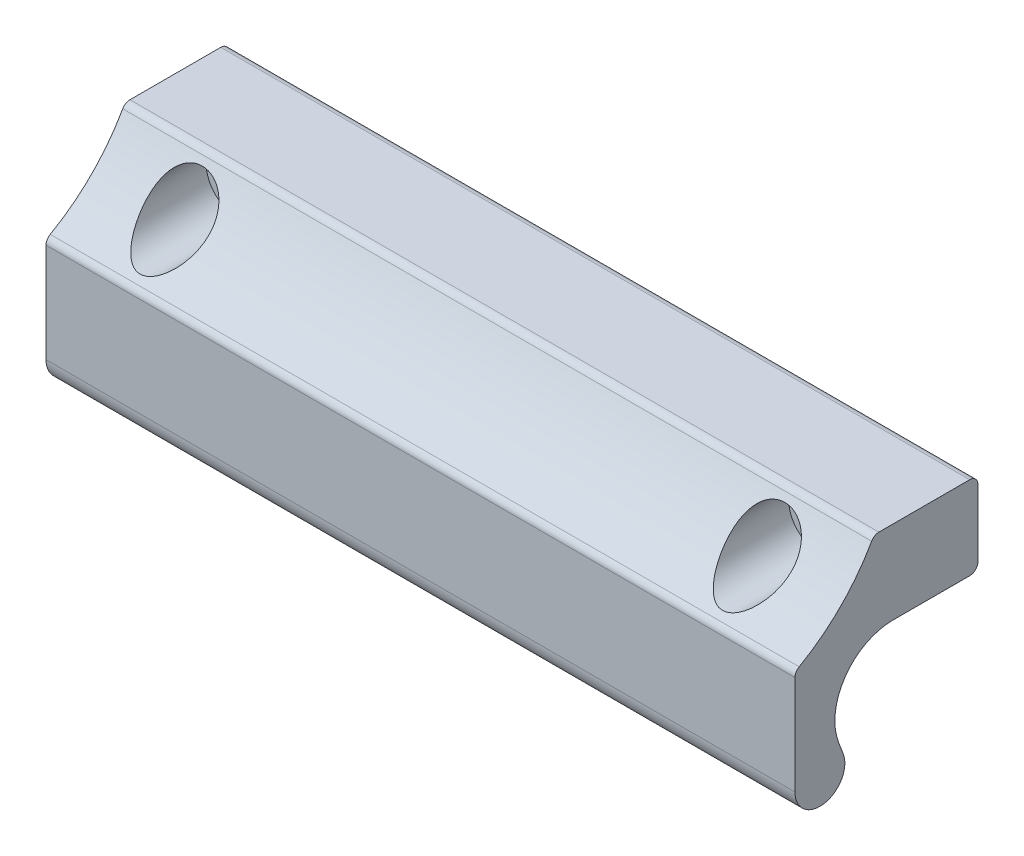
ISO-10303-21;
HEADER;
FILE_DESCRIPTION(('STEP AP214'),'2;1');
FILE_NAME('part.step','',(''),(''),'','','');
FILE_SCHEMA(('AUTOMOTIVE_DESIGN { 1 0 10303 214 1 1 1 1 }'));
ENDSEC;
DATA;
#1=APPLICATION_CONTEXT('core data for automotive mechanical design processes');
#2=APPLICATION_PROTOCOL_DEFINITION('international standard','automotive_design',2000,#1);
#3=PRODUCT_CONTEXT('',#1,'mechanical');
#4=PRODUCT('Part','Part','',(#3));
#5=PRODUCT_RELATED_PRODUCT_CATEGORY('part','',(#4));
#6=PRODUCT_DEFINITION_FORMATION('','',#4);
#7=PRODUCT_DEFINITION_CONTEXT('part definition',#1,'design');
#8=PRODUCT_DEFINITION('design','',#6,#7);
#9=PRODUCT_DEFINITION_SHAPE('','',#8);
#10=(LENGTH_UNIT() NAMED_UNIT(*) SI_UNIT(.MILLI.,.METRE.));
#11=(NAMED_UNIT(*) PLANE_ANGLE_UNIT() SI_UNIT($,.RADIAN.));
#12=(NAMED_UNIT(*) SI_UNIT($,.STERADIAN.) SOLID_ANGLE_UNIT());
#13=UNCERTAINTY_MEASURE_WITH_UNIT(LENGTH_MEASURE(1.E-05),#10,'distance_accuracy_value','');
#14=(GEOMETRIC_REPRESENTATION_CONTEXT(3) GLOBAL_UNCERTAINTY_ASSIGNED_CONTEXT((#13)) GLOBAL_UNIT_ASSIGNED_CONTEXT((#10,
#11,#12)) REPRESENTATION_CONTEXT('',''));
#15=CARTESIAN_POINT('',(0.,0.,0.));
#16=DIRECTION('',(0.,0.,1.));
#17=DIRECTION('',(1.,0.,0.));
#18=AXIS2_PLACEMENT_3D('',#15,#16,#17);
#19=CARTESIAN_POINT('',(-10.,15.8043402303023,32.8043402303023));
#20=DIRECTION('',(1.,0.,0.));
#21=DIRECTION('',(0.,1.,0.));
#22=AXIS2_PLACEMENT_3D('',#19,#20,#21);
#23=CYLINDRICAL_SURFACE('',#22,23.);
#24=CARTESIAN_POINT('',(73.75,0.,16.094378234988));
#25=CARTESIAN_POINT('',(73.7500006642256,-0.150169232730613,16.236409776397));
#26=CARTESIAN_POINT('',(73.7409857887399,-0.298458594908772,16.3805076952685));
#27=CARTESIAN_POINT('',(73.7061827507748,-0.590181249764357,16.6716960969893));
#28=CARTESIAN_POINT('',(73.6803814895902,-0.733610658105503,16.8187888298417));
#29=CARTESIAN_POINT('',(73.6128217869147,-1.01544237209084,17.1155863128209));
#30=CARTESIAN_POINT('',(73.5709823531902,-1.15381519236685,17.2653005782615));
#31=CARTESIAN_POINT('',(73.4720695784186,-1.42405592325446,17.5654707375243));
#32=CARTESIAN_POINT('',(73.4150003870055,-1.55592559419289,17.7159264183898));
#33=CARTESIAN_POINT('',(73.2849647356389,-1.81460439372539,18.0187712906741));
#34=CARTESIAN_POINT('',(73.2117670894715,-1.9413043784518,18.1711545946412));
#35=CARTESIAN_POINT('',(73.0498715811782,-2.1868769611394,18.4741574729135));
#36=CARTESIAN_POINT('',(72.9611662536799,-2.30574575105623,18.6247761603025));
#37=CARTESIAN_POINT('',(72.7681376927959,-2.53420019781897,18.9215160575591));
#38=CARTESIAN_POINT('',(72.6638971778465,-2.64383047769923,19.067656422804));
#39=CARTESIAN_POINT('',(72.4382918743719,-2.853229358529,19.3534526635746));
#40=CARTESIAN_POINT('',(72.316948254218,-2.95300989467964,19.493116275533));
#41=CARTESIAN_POINT('',(72.0789502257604,-3.12374564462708,19.7373761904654));
#42=CARTESIAN_POINT('',(71.965498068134,-3.19663498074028,19.8437139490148));
#43=CARTESIAN_POINT('',(71.7241156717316,-3.33304729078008,20.045999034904));
#44=CARTESIAN_POINT('',(71.5961684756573,-3.39655909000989,20.1419339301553));
#45=CARTESIAN_POINT('',(71.3222714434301,-3.51232726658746,20.3192407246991));
#46=CARTESIAN_POINT('',(71.1760841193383,-3.56440400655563,20.4003772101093));
#47=CARTESIAN_POINT('',(70.9451529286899,-3.62981593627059,20.5033135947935));
#48=CARTESIAN_POINT('',(70.8663403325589,-3.64948596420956,20.5344702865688));
#49=CARTESIAN_POINT('',(70.7051956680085,-3.68401760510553,20.5893923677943));
#50=CARTESIAN_POINT('',(70.6228662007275,-3.69888270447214,20.6131631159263));
#51=CARTESIAN_POINT('',(70.4293848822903,-3.72697994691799,20.658210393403));
#52=CARTESIAN_POINT('',(70.3172035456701,-3.73828046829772,20.6764343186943));
#53=CARTESIAN_POINT('',(70.0908651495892,-3.75060996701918,20.6963234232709));
#54=CARTESIAN_POINT('',(69.9767093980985,-3.75164550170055,20.6979991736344));
#55=CARTESIAN_POINT('',(69.7498794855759,-3.74336926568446,20.6846411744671));
#56=CARTESIAN_POINT('',(69.6372042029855,-3.73406584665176,20.669620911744));
#57=CARTESIAN_POINT('',(69.4161596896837,-3.70595298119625,20.6244737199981));
#58=CARTESIAN_POINT('',(69.3077946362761,-3.68713454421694,20.5943325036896));
#59=CARTESIAN_POINT('',(69.0562251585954,-3.6323825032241,20.5072938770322));
#60=CARTESIAN_POINT('',(68.9158969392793,-3.59263719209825,20.4445472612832));
#61=CARTESIAN_POINT('',(68.6486494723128,-3.50092089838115,20.3017774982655));
#62=CARTESIAN_POINT('',(68.5217650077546,-3.44891927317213,20.2217110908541));
#63=CARTESIAN_POINT('',(68.303724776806,-3.34616134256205,20.0659999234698));
#64=CARTESIAN_POINT('',(68.2103375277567,-3.29701024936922,19.9923557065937));
#65=CARTESIAN_POINT('',(68.0314834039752,-3.19345122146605,19.839292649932));
#66=CARTESIAN_POINT('',(67.946021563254,-3.13903998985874,19.7598701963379));
#67=CARTESIAN_POINT('',(67.7823320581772,-3.02562036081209,19.5966727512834));
#68=CARTESIAN_POINT('',(67.704116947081,-2.96660430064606,19.5128905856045));
#69=CARTESIAN_POINT('',(67.554530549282,-2.84455534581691,19.3421814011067));
#70=CARTESIAN_POINT('',(67.4831614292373,-2.7815211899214,19.255253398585));
#71=CARTESIAN_POINT('',(67.3069800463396,-2.61388606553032,19.0275868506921));
#72=CARTESIAN_POINT('',(67.2070155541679,-2.50653247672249,18.8851063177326));
#73=CARTESIAN_POINT('',(67.022064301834,-2.28371602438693,18.5967547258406));
#74=CARTESIAN_POINT('',(66.9370856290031,-2.16824882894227,18.4508818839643));
#75=CARTESIAN_POINT('',(66.7815301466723,-1.92982538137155,18.1573214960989));
#76=CARTESIAN_POINT('',(66.710967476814,-1.80686192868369,18.0096323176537));
#77=CARTESIAN_POINT('',(66.5842889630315,-1.55415187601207,17.7139267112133));
#78=CARTESIAN_POINT('',(66.5281703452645,-1.42440658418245,17.565910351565));
#79=CARTESIAN_POINT('',(66.4294697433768,-1.15535678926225,17.2669625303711));
#80=CARTESIAN_POINT('',(66.3872582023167,-1.01589497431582,17.116049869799));
#81=CARTESIAN_POINT('',(66.3190319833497,-0.731044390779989,16.8160994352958));
#82=CARTESIAN_POINT('',(66.293019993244,-0.585654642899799,16.667061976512));
#83=CARTESIAN_POINT('',(66.25828003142,-0.29005579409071,16.3722410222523));
#84=CARTESIAN_POINT('',(66.2495221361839,-0.139855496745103,16.2264523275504));
#85=CARTESIAN_POINT('',(66.2505179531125,0.164377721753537,15.9391279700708));
#86=CARTESIAN_POINT('',(66.2602636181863,0.318408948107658,15.7975904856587));
#87=CARTESIAN_POINT('',(66.3079126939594,0.692581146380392,15.4630412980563));
#88=CARTESIAN_POINT('',(66.3557102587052,0.913971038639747,15.2726783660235));
#89=CARTESIAN_POINT('',(66.495799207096,1.35518812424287,14.9073062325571));
#90=CARTESIAN_POINT('',(66.588026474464,1.57501710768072,14.7322753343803));
#91=CARTESIAN_POINT('',(66.7991197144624,1.9636736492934,14.4335970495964));
#92=CARTESIAN_POINT('',(66.909662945,2.13429131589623,14.3064889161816));
#93=CARTESIAN_POINT('',(67.1001727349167,2.3799745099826,14.1282393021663));
#94=CARTESIAN_POINT('',(67.1678322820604,2.46019965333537,14.0708656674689));
#95=CARTESIAN_POINT('',(67.3113580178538,2.61628143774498,13.9606622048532));
#96=CARTESIAN_POINT('',(67.3872204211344,2.69214006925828,13.907830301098));
#97=CARTESIAN_POINT('',(67.5477452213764,2.83917333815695,13.806643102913));
#98=CARTESIAN_POINT('',(67.6324832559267,2.91029755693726,13.758334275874));
#99=CARTESIAN_POINT('',(67.8097619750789,3.04594886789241,13.6672003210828));
#100=CARTESIAN_POINT('',(67.902298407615,3.11047951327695,13.6243722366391));
#101=CARTESIAN_POINT('',(68.0946077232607,3.23185755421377,13.5445905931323));
#102=CARTESIAN_POINT('',(68.1943773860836,3.28870833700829,13.5076344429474));
#103=CARTESIAN_POINT('',(68.4004020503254,3.39369189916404,13.4399472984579));
#104=CARTESIAN_POINT('',(68.5066557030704,3.44182648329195,13.4092150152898));
#105=CARTESIAN_POINT('',(68.7083226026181,3.52193401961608,13.3584049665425));
#106=CARTESIAN_POINT('',(68.8029778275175,3.55524764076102,13.3374209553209));
#107=CARTESIAN_POINT('',(68.9955300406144,3.61437106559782,13.3003439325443));
#108=CARTESIAN_POINT('',(69.0934265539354,3.64018196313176,13.2842502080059));
#109=CARTESIAN_POINT('',(69.2915997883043,3.68387839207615,13.2570880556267));
#110=CARTESIAN_POINT('',(69.3918751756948,3.70176825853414,13.2460168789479));
#111=CARTESIAN_POINT('',(69.5939747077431,3.72934871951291,13.2289770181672));
#112=CARTESIAN_POINT('',(69.6957987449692,3.73903988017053,13.2230079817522));
#113=CARTESIAN_POINT('',(69.8896006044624,3.74949905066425,13.2165676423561));
#114=CARTESIAN_POINT('',(69.9815192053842,3.751079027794,13.2155960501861));
#115=CARTESIAN_POINT('',(70.1652063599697,3.7474856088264,13.2178075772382));
#116=CARTESIAN_POINT('',(70.2569748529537,3.74230994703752,13.2209920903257));
#117=CARTESIAN_POINT('',(70.4395972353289,3.72527248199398,13.2314961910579));
#118=CARTESIAN_POINT('',(70.5304516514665,3.71341478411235,13.2388132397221));
#119=CARTESIAN_POINT('',(70.7106535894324,3.68318293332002,13.2575283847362));
#120=CARTESIAN_POINT('',(70.8000005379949,3.66480635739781,13.2689279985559));
#121=CARTESIAN_POINT('',(71.0615737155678,3.60101108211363,13.3086664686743));
#122=CARTESIAN_POINT('',(71.2308516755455,3.54658365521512,13.3427515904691));
#123=CARTESIAN_POINT('',(71.5568664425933,3.41607587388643,13.4255677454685));
#124=CARTESIAN_POINT('',(71.7136012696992,3.33999210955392,13.4743010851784));
#125=CARTESIAN_POINT('',(72.0192314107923,3.1650856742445,13.5881842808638));
#126=CARTESIAN_POINT('',(72.1672994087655,3.06528886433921,13.6540540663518));
#127=CARTESIAN_POINT('',(72.443829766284,2.84973334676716,13.7992083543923));
#128=CARTESIAN_POINT('',(72.5722875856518,2.73397095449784,13.8784959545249));
#129=CARTESIAN_POINT('',(72.8221710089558,2.47661423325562,14.0586987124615));
#130=CARTESIAN_POINT('',(72.9410681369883,2.33358067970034,14.1610543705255));
#131=CARTESIAN_POINT('',(73.1530779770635,2.03807613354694,14.378170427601));
#132=CARTESIAN_POINT('',(73.2461621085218,1.8855949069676,14.4929443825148));
#133=CARTESIAN_POINT('',(73.4441188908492,1.50504726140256,14.7873723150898));
#134=CARTESIAN_POINT('',(73.5350714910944,1.27416834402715,14.9727785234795));
#135=CARTESIAN_POINT('',(73.668890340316,0.812200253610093,15.3593785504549));
#136=CARTESIAN_POINT('',(73.7117581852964,0.581111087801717,15.5605718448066));
#137=CARTESIAN_POINT('',(73.7389347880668,0.293978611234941,15.8209607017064));
#138=CARTESIAN_POINT('',(73.7431071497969,0.234797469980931,15.8751995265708));
#139=CARTESIAN_POINT('',(73.7486383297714,0.116983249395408,15.9843147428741));
#140=CARTESIAN_POINT('',(73.7499997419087,0.0583497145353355,16.0391904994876));
#141=CARTESIAN_POINT('',(73.75,0.,16.094378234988));
#142=B_SPLINE_CURVE_WITH_KNOTS('',3,(#24,#25,#26,#27,#28,#29,#30,#31,#32,#33,#34,#35,#36,#37,
#38,#39,#40,#41,#42,#43,#44,#45,#46,#47,#48,#49,#50,#51,#52,#53,#54,#55,#56,#57,#58,#59,#60,#61,
#62,#63,#64,#65,#66,#67,#68,#69,#70,#71,#72,#73,#74,#75,#76,#77,#78,#79,#80,#81,#82,#83,#84,#85,
#86,#87,#88,#89,#90,#91,#92,#93,#94,#95,#96,#97,#98,#99,#100,#101,#102,#103,#104,#105,#106,#107,
#108,#109,#110,#111,#112,#113,#114,#115,#116,#117,#118,#119,#120,#121,#122,#123,#124,#125,#126,
#127,#128,#129,#130,#131,#132,#133,#134,#135,#136,#137,#138,#139,#140,#141),.UNSPECIFIED.,.T.,
.F.,(4,2,2,2,2,2,2,2,2,2,2,2,2,2,2,2,2,2,2,2,2,2,2,2,2,2,2,2,2,2,2,2,2,2,2,2,2,2,2,2,2,2,2,2,2,
2,2,2,2,2,2,2,2,2,2,2,2,2,4),(0.,0.620002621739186,1.24048962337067,1.8641522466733,
2.48764511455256,3.12073548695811,3.75413147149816,4.38426801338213,5.01363137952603,
5.52787354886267,6.04272365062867,6.56516003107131,6.82572511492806,7.08610070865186,
7.42711756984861,7.76791657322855,8.10844048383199,8.44928675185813,8.92293422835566,
9.39777869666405,9.78331644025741,10.1690974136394,10.5555346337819,10.9420937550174,
11.5546950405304,12.1676259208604,12.7811551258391,13.3945664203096,14.0231985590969,
14.6519349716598,15.2795800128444,15.9069521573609,16.7911651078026,17.6741058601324,
18.3902630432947,18.7487042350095,19.1069807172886,19.4686065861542,19.8300365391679,
20.1913065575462,20.5525016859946,20.8596314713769,21.166716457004,21.4736331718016,
21.7805286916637,22.056004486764,22.3315726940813,22.606971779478,22.8824733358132,
23.422984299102,23.9635804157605,24.532194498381,25.100940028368,25.7354158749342,
26.370591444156,27.2948858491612,28.2191495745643,28.4602802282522,28.7011882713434),.UNSPECIFIED.);
#143=CARTESIAN_POINT('',(73.75,0.,16.094378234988));
#144=VERTEX_POINT('',#143);
#145=EDGE_CURVE('E18',#144,#144,#142,.T.);
#146=ORIENTED_EDGE('',*,*,#145,.T.);
#147=EDGE_LOOP('',(#146));
#148=FACE_BOUND('',#147,.T.);
#149=CARTESIAN_POINT('',(3.75,0.,16.094378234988));
#150=CARTESIAN_POINT('',(3.75000066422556,-0.150169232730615,16.236409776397));
#151=CARTESIAN_POINT('',(3.74098578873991,-0.298458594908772,16.3805076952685));
#152=CARTESIAN_POINT('',(3.70618275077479,-0.590181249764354,16.6716960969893));
#153=CARTESIAN_POINT('',(3.68038148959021,-0.7336106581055,16.8187888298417));
#154=CARTESIAN_POINT('',(3.61282178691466,-1.01544237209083,17.1155863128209));
#155=CARTESIAN_POINT('',(3.57098235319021,-1.15381519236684,17.2653005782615));
#156=CARTESIAN_POINT('',(3.47206957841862,-1.42405592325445,17.5654707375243));
#157=CARTESIAN_POINT('',(3.41500038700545,-1.55592559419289,17.7159264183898));
#158=CARTESIAN_POINT('',(3.28496473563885,-1.81460439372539,18.0187712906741));
#159=CARTESIAN_POINT('',(3.21176708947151,-1.9413043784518,18.1711545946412));
#160=CARTESIAN_POINT('',(3.04987158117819,-2.1868769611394,18.4741574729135));
#161=CARTESIAN_POINT('',(2.96116625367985,-2.30574575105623,18.6247761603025));
#162=CARTESIAN_POINT('',(2.76813769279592,-2.53420019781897,18.9215160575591));
#163=CARTESIAN_POINT('',(2.66389717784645,-2.64383047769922,19.067656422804));
#164=CARTESIAN_POINT('',(2.43829187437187,-2.853229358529,19.3534526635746));
#165=CARTESIAN_POINT('',(2.316948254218,-2.95300989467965,19.493116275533));
#166=CARTESIAN_POINT('',(2.07895022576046,-3.12374564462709,19.7373761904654));
#167=CARTESIAN_POINT('',(1.965498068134,-3.19663498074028,19.8437139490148));
#168=CARTESIAN_POINT('',(1.72411567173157,-3.33304729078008,20.045999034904));
#169=CARTESIAN_POINT('',(1.59616847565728,-3.3965590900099,20.1419339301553));
#170=CARTESIAN_POINT('',(1.32227144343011,-3.51232726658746,20.3192407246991));
#171=CARTESIAN_POINT('',(1.1760841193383,-3.56440400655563,20.4003772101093));
#172=CARTESIAN_POINT('',(0.9451529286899,-3.62981593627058,20.5033135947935));
#173=CARTESIAN_POINT('',(0.866340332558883,-3.64948596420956,20.5344702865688));
#174=CARTESIAN_POINT('',(0.705195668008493,-3.68401760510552,20.5893923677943));
#175=CARTESIAN_POINT('',(0.622866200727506,-3.69888270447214,20.6131631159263));
#176=CARTESIAN_POINT('',(0.429384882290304,-3.72697994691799,20.658210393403));
#177=CARTESIAN_POINT('',(0.31720354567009,-3.73828046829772,20.6764343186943));
#178=CARTESIAN_POINT('',(0.0908651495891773,-3.75060996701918,20.6963234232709));
#179=CARTESIAN_POINT('',(-0.0232906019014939,-3.75164550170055,20.6979991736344));
#180=CARTESIAN_POINT('',(-0.250120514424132,-3.74336926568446,20.6846411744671));
#181=CARTESIAN_POINT('',(-0.362795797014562,-3.73406584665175,20.669620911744));
#182=CARTESIAN_POINT('',(-0.583840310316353,-3.70595298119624,20.6244737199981));
#183=CARTESIAN_POINT('',(-0.692205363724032,-3.68713454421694,20.5943325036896));
#184=CARTESIAN_POINT('',(-0.943774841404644,-3.63238250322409,20.5072938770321));
#185=CARTESIAN_POINT('',(-1.0841030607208,-3.59263719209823,20.4445472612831));
#186=CARTESIAN_POINT('',(-1.35135052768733,-3.50092089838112,20.3017774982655));
#187=CARTESIAN_POINT('',(-1.47823499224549,-3.44891927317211,20.221711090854));
#188=CARTESIAN_POINT('',(-1.6962752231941,-3.34616134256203,20.0659999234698));
#189=CARTESIAN_POINT('',(-1.7896624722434,-3.29701024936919,19.9923557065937));
#190=CARTESIAN_POINT('',(-1.9685165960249,-3.19345122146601,19.839292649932));
#191=CARTESIAN_POINT('',(-2.0539784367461,-3.1390399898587,19.7598701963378));
#192=CARTESIAN_POINT('',(-2.21766794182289,-3.02562036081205,19.5966727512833));
#193=CARTESIAN_POINT('',(-2.29588305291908,-2.96660430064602,19.5128905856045));
#194=CARTESIAN_POINT('',(-2.44546945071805,-2.84455534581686,19.3421814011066));
#195=CARTESIAN_POINT('',(-2.51683857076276,-2.78152118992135,19.255253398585));
#196=CARTESIAN_POINT('',(-2.69301995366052,-2.61388606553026,19.0275868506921));
#197=CARTESIAN_POINT('',(-2.79298444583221,-2.50653247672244,18.8851063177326));
#198=CARTESIAN_POINT('',(-2.97793569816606,-2.28371602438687,18.5967547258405));
#199=CARTESIAN_POINT('',(-3.06291437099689,-2.16824882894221,18.4508818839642));
#200=CARTESIAN_POINT('',(-3.21846985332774,-1.92982538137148,18.1573214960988));
#201=CARTESIAN_POINT('',(-3.28903252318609,-1.80686192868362,18.0096323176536));
#202=CARTESIAN_POINT('',(-3.41571103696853,-1.554151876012,17.7139267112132));
#203=CARTESIAN_POINT('',(-3.47182965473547,-1.42440658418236,17.5659103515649));
#204=CARTESIAN_POINT('',(-3.57053025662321,-1.15535678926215,17.266962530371));
#205=CARTESIAN_POINT('',(-3.61274179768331,-1.01589497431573,17.1160498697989));
#206=CARTESIAN_POINT('',(-3.68096801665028,-0.731044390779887,16.8160994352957));
#207=CARTESIAN_POINT('',(-3.70698000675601,-0.585654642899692,16.6670619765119));
#208=CARTESIAN_POINT('',(-3.74171996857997,-0.290055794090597,16.3722410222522));
#209=CARTESIAN_POINT('',(-3.75047786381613,-0.139855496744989,16.2264523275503));
#210=CARTESIAN_POINT('',(-3.74948204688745,0.164377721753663,15.9391279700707));
#211=CARTESIAN_POINT('',(-3.73973638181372,0.318408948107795,15.7975904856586));
#212=CARTESIAN_POINT('',(-3.69208730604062,0.692581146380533,15.4630412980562));
#213=CARTESIAN_POINT('',(-3.64428974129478,0.913971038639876,15.2726783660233));
#214=CARTESIAN_POINT('',(-3.50420079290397,1.35518812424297,14.907306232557));
#215=CARTESIAN_POINT('',(-3.41197352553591,1.57501710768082,14.7322753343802));
#216=CARTESIAN_POINT('',(-3.20088028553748,1.9636736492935,14.4335970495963));
#217=CARTESIAN_POINT('',(-3.09033705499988,2.13429131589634,14.3064889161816));
#218=CARTESIAN_POINT('',(-2.89982726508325,2.37997450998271,14.1282393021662));
#219=CARTESIAN_POINT('',(-2.83216771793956,2.46019965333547,14.0708656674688));
#220=CARTESIAN_POINT('',(-2.68864198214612,2.61628143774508,13.9606622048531));
#221=CARTESIAN_POINT('',(-2.61277957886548,2.69214006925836,13.9078303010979));
#222=CARTESIAN_POINT('',(-2.45225477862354,2.83917333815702,13.806643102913));
#223=CARTESIAN_POINT('',(-2.3675167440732,2.91029755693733,13.758334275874));
#224=CARTESIAN_POINT('',(-2.19023802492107,3.04594886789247,13.6672003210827));
#225=CARTESIAN_POINT('',(-2.09770159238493,3.11047951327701,13.624372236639));
#226=CARTESIAN_POINT('',(-1.90539227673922,3.23185755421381,13.5445905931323));
#227=CARTESIAN_POINT('',(-1.80562261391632,3.28870833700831,13.5076344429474));
#228=CARTESIAN_POINT('',(-1.59959794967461,3.39369189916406,13.4399472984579));
#229=CARTESIAN_POINT('',(-1.49334429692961,3.44182648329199,13.4092150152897));
#230=CARTESIAN_POINT('',(-1.29167739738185,3.52193401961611,13.3584049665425));
#231=CARTESIAN_POINT('',(-1.19702217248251,3.55524764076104,13.3374209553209));
#232=CARTESIAN_POINT('',(-1.00446995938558,3.61437106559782,13.3003439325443));
#233=CARTESIAN_POINT('',(-0.906573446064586,3.64018196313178,13.2842502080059));
#234=CARTESIAN_POINT('',(-0.708400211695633,3.68387839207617,13.2570880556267));
#235=CARTESIAN_POINT('',(-0.608124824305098,3.70176825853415,13.2460168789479));
#236=CARTESIAN_POINT('',(-0.4060252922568,3.72934871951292,13.2289770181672));
#237=CARTESIAN_POINT('',(-0.304201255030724,3.73903988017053,13.2230079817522));
#238=CARTESIAN_POINT('',(-0.110399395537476,3.74949905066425,13.2165676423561));
#239=CARTESIAN_POINT('',(-0.018480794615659,3.751079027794,13.2155960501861));
#240=CARTESIAN_POINT('',(0.165206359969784,3.74748560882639,13.2178075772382));
#241=CARTESIAN_POINT('',(0.256974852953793,3.74230994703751,13.2209920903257));
#242=CARTESIAN_POINT('',(0.439597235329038,3.72527248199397,13.2314961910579));
#243=CARTESIAN_POINT('',(0.530451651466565,3.71341478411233,13.2388132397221));
#244=CARTESIAN_POINT('',(0.710653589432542,3.68318293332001,13.2575283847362));
#245=CARTESIAN_POINT('',(0.800000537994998,3.66480635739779,13.2689279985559));
#246=CARTESIAN_POINT('',(1.06157371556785,3.60101108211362,13.3086664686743));
#247=CARTESIAN_POINT('',(1.23085167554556,3.54658365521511,13.3427515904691));
#248=CARTESIAN_POINT('',(1.55686644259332,3.4160758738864,13.4255677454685));
#249=CARTESIAN_POINT('',(1.7136012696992,3.33999210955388,13.4743010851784));
#250=CARTESIAN_POINT('',(2.01923141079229,3.16508567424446,13.5881842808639));
#251=CARTESIAN_POINT('',(2.16729940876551,3.06528886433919,13.6540540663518));
#252=CARTESIAN_POINT('',(2.44382976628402,2.84973334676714,13.7992083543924));
#253=CARTESIAN_POINT('',(2.57228758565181,2.7339709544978,13.878495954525));
#254=CARTESIAN_POINT('',(2.82217100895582,2.47661423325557,14.0586987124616));
#255=CARTESIAN_POINT('',(2.94106813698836,2.3335806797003,14.1610543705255));
#256=CARTESIAN_POINT('',(3.15307797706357,2.03807613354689,14.378170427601));
#257=CARTESIAN_POINT('',(3.24616210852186,1.88559490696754,14.4929443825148));
#258=CARTESIAN_POINT('',(3.44411889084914,1.50504726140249,14.7873723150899));
#259=CARTESIAN_POINT('',(3.53507149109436,1.27416834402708,14.9727785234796));
#260=CARTESIAN_POINT('',(3.66889034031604,0.812200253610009,15.3593785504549));
#261=CARTESIAN_POINT('',(3.71175818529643,0.581111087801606,15.5605718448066));
#262=CARTESIAN_POINT('',(3.73893478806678,0.293978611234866,15.8209607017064));
#263=CARTESIAN_POINT('',(3.74310714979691,0.234797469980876,15.8751995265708));
#264=CARTESIAN_POINT('',(3.74863832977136,0.116983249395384,15.9843147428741));
#265=CARTESIAN_POINT('',(3.7499997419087,0.0583497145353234,16.0391904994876));
#266=CARTESIAN_POINT('',(3.75,0.,16.094378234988));
#267=B_SPLINE_CURVE_WITH_KNOTS('',3,(#149,#150,#151,#152,#153,#154,#155,#156,#157,#158,#159,
#160,#161,#162,#163,#164,#165,#166,#167,#168,#169,#170,#171,#172,#173,#174,#175,#176,#177,#178,
#179,#180,#181,#182,#183,#184,#185,#186,#187,#188,#189,#190,#191,#192,#193,#194,#195,#196,#197,
#198,#199,#200,#201,#202,#203,#204,#205,#206,#207,#208,#209,#210,#211,#212,#213,#214,#215,#216,
#217,#218,#219,#220,#221,#222,#223,#224,#225,#226,#227,#228,#229,#230,#231,#232,#233,#234,#235,
#236,#237,#238,#239,#240,#241,#242,#243,#244,#245,#246,#247,#248,#249,#250,#251,#252,#253,#254,
#255,#256,#257,#258,#259,#260,#261,#262,#263,#264,#265,#266),.UNSPECIFIED.,.T.,.F.,(4,2,2,2,2,2,
2,2,2,2,2,2,2,2,2,2,2,2,2,2,2,2,2,2,2,2,2,2,2,2,2,2,2,2,2,2,2,2,2,2,2,2,2,2,2,2,2,2,2,2,2,2,2,2,
2,2,2,2,4),(0.,0.62000262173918,1.24048962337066,1.8641522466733,2.48764511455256,
3.12073548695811,3.75413147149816,4.38426801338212,5.01363137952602,5.52787354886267,
6.04272365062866,6.56516003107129,6.82572511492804,7.08610070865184,7.42711756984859,
7.76791657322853,8.10844048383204,8.44928675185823,8.92293422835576,9.39777869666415,
9.78331644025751,10.1690974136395,10.555534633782,10.9420937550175,11.5546950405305,
12.1676259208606,12.7811551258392,13.3945664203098,14.0231985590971,14.65193497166,
15.2795800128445,15.9069521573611,16.7911651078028,17.6741058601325,18.3902630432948,
18.7487042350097,19.1069807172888,19.4686065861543,19.830036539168,20.1913065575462,
20.5525016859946,20.859631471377,21.1667164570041,21.4736331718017,21.7805286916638,
22.0560044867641,22.3315726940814,22.6069717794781,22.8824733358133,23.422984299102,
23.9635804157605,24.532194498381,25.1009400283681,25.7354158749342,26.3705914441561,
27.2948858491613,28.2191495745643,28.4602802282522,28.7011882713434),.UNSPECIFIED.);
#268=CARTESIAN_POINT('',(3.75,0.,16.094378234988));
#269=VERTEX_POINT('',#268);
#270=EDGE_CURVE('E131',#269,#269,#267,.T.);
#271=ORIENTED_EDGE('',*,*,#270,.T.);
#272=EDGE_LOOP('',(#271));
#273=FACE_BOUND('',#272,.T.);
#274=DIRECTION('',(1.,0.,0.));
#275=VECTOR('',#274,1.);
#276=CARTESIAN_POINT('',(-10.,-4.22133100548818,21.4918475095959));
#277=LINE('',#276,#275);
#278=CARTESIAN_POINT('',(-10.,-4.22133100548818,21.4918475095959));
#279=VERTEX_POINT('',#278);
#280=CARTESIAN_POINT('',(80.,-4.22133100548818,21.4918475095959));
#281=VERTEX_POINT('',#280);
#282=EDGE_CURVE('E127',#279,#281,#277,.T.);
#283=ORIENTED_EDGE('',*,*,#282,.T.);
#284=CARTESIAN_POINT('',(80.,15.8043402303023,32.8043402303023));
#285=DIRECTION('',(1.,0.,0.));
#286=DIRECTION('',(0.,-1.,0.));
#287=AXIS2_PLACEMENT_3D('',#284,#285,#286);
#288=CIRCLE('',#287,23.);
#289=CARTESIAN_POINT('',(80.,4.49184750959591,12.7786689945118));
#290=VERTEX_POINT('',#289);
#291=EDGE_CURVE('E121',#281,#290,#288,.T.);
#292=ORIENTED_EDGE('',*,*,#291,.T.);
#293=DIRECTION('',(1.,0.,0.));
#294=VECTOR('',#293,1.);
#295=CARTESIAN_POINT('',(-10.,4.49184750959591,12.7786689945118));
#296=LINE('',#295,#294);
#297=CARTESIAN_POINT('',(-10.,4.49184750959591,12.7786689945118));
#298=VERTEX_POINT('',#297);
#299=EDGE_CURVE('E9',#298,#290,#296,.T.);
#300=ORIENTED_EDGE('',*,*,#299,.F.);
#301=CARTESIAN_POINT('',(-10.,15.8043402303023,32.8043402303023));
#302=DIRECTION('',(1.,0.,0.));
#303=DIRECTION('',(0.,-1.,0.));
#304=AXIS2_PLACEMENT_3D('',#301,#302,#303);
#305=CIRCLE('',#304,23.);
#306=EDGE_CURVE('E162',#279,#298,#305,.T.);
#307=ORIENTED_EDGE('',*,*,#306,.F.);
#308=EDGE_LOOP('',(#283,#292,#300,#307));
#309=FACE_BOUND('',#308,.T.);
#310=ADVANCED_FACE('F14',(#148,#273,#309),#23,.F.);
#311=CARTESIAN_POINT('',(-10.,4.,11.907987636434));
#312=DIRECTION('',(1.,0.,0.));
#313=DIRECTION('',(0.,1.,0.));
#314=AXIS2_PLACEMENT_3D('',#311,#312,#313);
#315=CYLINDRICAL_SURFACE('',#314,1.);
#316=ORIENTED_EDGE('',*,*,#299,.T.);
#317=CARTESIAN_POINT('',(80.,4.,11.907987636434));
#318=DIRECTION('',(-1.,0.,0.));
#319=DIRECTION('',(0.,-1.,0.));
#320=AXIS2_PLACEMENT_3D('',#317,#318,#319);
#321=CIRCLE('',#320,1.);
#322=CARTESIAN_POINT('',(80.,5.,11.907987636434));
#323=VERTEX_POINT('',#322);
#324=EDGE_CURVE('E111',#290,#323,#321,.T.);
#325=ORIENTED_EDGE('',*,*,#324,.T.);
#326=DIRECTION('',(1.,0.,0.));
#327=VECTOR('',#326,1.);
#328=CARTESIAN_POINT('',(-10.,5.,11.907987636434));
#329=LINE('',#328,#327);
#330=CARTESIAN_POINT('',(-10.,5.,11.907987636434));
#331=VERTEX_POINT('',#330);
#332=EDGE_CURVE('E27',#331,#323,#329,.T.);
#333=ORIENTED_EDGE('',*,*,#332,.F.);
#334=CARTESIAN_POINT('',(-10.,4.,11.907987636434));
#335=DIRECTION('',(-1.,0.,0.));
#336=DIRECTION('',(0.,-1.,0.));
#337=AXIS2_PLACEMENT_3D('',#334,#335,#336);
#338=CIRCLE('',#337,1.);
#339=EDGE_CURVE('E112',#298,#331,#338,.T.);
#340=ORIENTED_EDGE('',*,*,#339,.F.);
#341=EDGE_LOOP('',(#316,#325,#333,#340));
#342=FACE_BOUND('',#341,.T.);
#343=ADVANCED_FACE('F109',(#342),#315,.T.);
#344=CARTESIAN_POINT('',(-10.,5.,11.907987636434));
#345=DIRECTION('',(0.,-1.,0.));
#346=DIRECTION('',(1.,0.,0.));
#347=AXIS2_PLACEMENT_3D('',#344,#345,#346);
#348=PLANE('',#347);
#349=ORIENTED_EDGE('',*,*,#332,.T.);
#350=DIRECTION('',(0.,0.,-1.));
#351=VECTOR('',#350,1.);
#352=CARTESIAN_POINT('',(80.,5.,11.907987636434));
#353=LINE('',#352,#351);
#354=CARTESIAN_POINT('',(80.,5.,1.));
#355=VERTEX_POINT('',#354);
#356=EDGE_CURVE('E125',#323,#355,#353,.T.);
#357=ORIENTED_EDGE('',*,*,#356,.T.);
#358=DIRECTION('',(1.,0.,0.));
#359=VECTOR('',#358,1.);
#360=CARTESIAN_POINT('',(-10.,5.,1.));
#361=LINE('',#360,#359);
#362=CARTESIAN_POINT('',(-10.,5.,1.));
#363=VERTEX_POINT('',#362);
#364=EDGE_CURVE('E200',#363,#355,#361,.T.);
#365=ORIENTED_EDGE('',*,*,#364,.F.);
#366=DIRECTION('',(0.,0.,-1.));
#367=VECTOR('',#366,1.);
#368=CARTESIAN_POINT('',(-10.,5.,11.907987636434));
#369=LINE('',#368,#367);
#370=EDGE_CURVE('E165',#331,#363,#369,.T.);
#371=ORIENTED_EDGE('',*,*,#370,.F.);
#372=EDGE_LOOP('',(#349,#357,#365,#371));
#373=FACE_BOUND('',#372,.T.);
#374=ADVANCED_FACE('F265',(#373),#348,.F.);
#375=CARTESIAN_POINT('',(-10.,4.,1.));
#376=DIRECTION('',(1.,0.,0.));
#377=DIRECTION('',(0.,1.,0.));
#378=AXIS2_PLACEMENT_3D('',#375,#376,#377);
#379=CYLINDRICAL_SURFACE('',#378,1.);
#380=ORIENTED_EDGE('',*,*,#364,.T.);
#381=CARTESIAN_POINT('',(80.,4.,1.));
#382=DIRECTION('',(-1.,0.,0.));
#383=DIRECTION('',(0.,-1.,0.));
#384=AXIS2_PLACEMENT_3D('',#381,#382,#383);
#385=CIRCLE('',#384,1.);
#386=CARTESIAN_POINT('',(80.,4.,0.));
#387=VERTEX_POINT('',#386);
#388=EDGE_CURVE('E136',#355,#387,#385,.T.);
#389=ORIENTED_EDGE('',*,*,#388,.T.);
#390=DIRECTION('',(1.,0.,0.));
#391=VECTOR('',#390,1.);
#392=CARTESIAN_POINT('',(-10.,4.,0.));
#393=LINE('',#392,#391);
#394=CARTESIAN_POINT('',(-10.,4.,0.));
#395=VERTEX_POINT('',#394);
#396=EDGE_CURVE('E198',#395,#387,#393,.T.);
#397=ORIENTED_EDGE('',*,*,#396,.F.);
#398=CARTESIAN_POINT('',(-10.,4.,1.));
#399=DIRECTION('',(-1.,0.,0.));
#400=DIRECTION('',(0.,-1.,0.));
#401=AXIS2_PLACEMENT_3D('',#398,#399,#400);
#402=CIRCLE('',#401,1.);
#403=EDGE_CURVE('E167',#363,#395,#402,.T.);
#404=ORIENTED_EDGE('',*,*,#403,.F.);
#405=EDGE_LOOP('',(#380,#389,#397,#404));
#406=FACE_BOUND('',#405,.T.);
#407=ADVANCED_FACE('F261',(#406),#379,.T.);
#408=CARTESIAN_POINT('',(-10.,4.,0.));
#409=DIRECTION('',(0.,0.,1.));
#410=DIRECTION('',(-1.,0.,0.));
#411=AXIS2_PLACEMENT_3D('',#408,#409,#410);
#412=PLANE('',#411);
#413=CARTESIAN_POINT('',(70.,0.,0.));
#414=DIRECTION('',(0.,0.,-1.));
#415=DIRECTION('',(1.,0.,0.));
#416=AXIS2_PLACEMENT_3D('',#413,#414,#415);
#417=CIRCLE('',#416,2.25);
#418=CARTESIAN_POINT('',(72.25,0.,0.));
#419=VERTEX_POINT('',#418);
#420=EDGE_CURVE('E285',#419,#419,#417,.T.);
#421=ORIENTED_EDGE('',*,*,#420,.F.);
#422=EDGE_LOOP('',(#421));
#423=FACE_BOUND('',#422,.T.);
#424=CARTESIAN_POINT('',(0.,0.,0.));
#425=DIRECTION('',(0.,0.,-1.));
#426=DIRECTION('',(1.,0.,0.));
#427=AXIS2_PLACEMENT_3D('',#424,#425,#426);
#428=CIRCLE('',#427,2.25);
#429=CARTESIAN_POINT('',(2.25,0.,0.));
#430=VERTEX_POINT('',#429);
#431=EDGE_CURVE('E128',#430,#430,#428,.T.);
#432=ORIENTED_EDGE('',*,*,#431,.F.);
#433=EDGE_LOOP('',(#432));
#434=FACE_BOUND('',#433,.T.);
#435=ORIENTED_EDGE('',*,*,#396,.T.);
#436=DIRECTION('',(0.,-1.,0.));
#437=VECTOR('',#436,1.);
#438=CARTESIAN_POINT('',(80.,4.,0.));
#439=LINE('',#438,#437);
#440=CARTESIAN_POINT('',(80.,-4.,0.));
#441=VERTEX_POINT('',#440);
#442=EDGE_CURVE('E139',#387,#441,#439,.T.);
#443=ORIENTED_EDGE('',*,*,#442,.T.);
#444=DIRECTION('',(1.,0.,0.));
#445=VECTOR('',#444,1.);
#446=CARTESIAN_POINT('',(-10.,-4.,0.));
#447=LINE('',#446,#445);
#448=CARTESIAN_POINT('',(-10.,-4.,0.));
#449=VERTEX_POINT('',#448);
#450=EDGE_CURVE('E196',#449,#441,#447,.T.);
#451=ORIENTED_EDGE('',*,*,#450,.F.);
#452=DIRECTION('',(0.,-1.,0.));
#453=VECTOR('',#452,1.);
#454=CARTESIAN_POINT('',(-10.,4.,0.));
#455=LINE('',#454,#453);
#456=EDGE_CURVE('E169',#395,#449,#455,.T.);
#457=ORIENTED_EDGE('',*,*,#456,.F.);
#458=EDGE_LOOP('',(#435,#443,#451,#457));
#459=FACE_BOUND('',#458,.T.);
#460=ADVANCED_FACE('F257',(#423,#434,#459),#412,.F.);
#461=CARTESIAN_POINT('',(-10.,-4.,1.));
#462=DIRECTION('',(1.,0.,0.));
#463=DIRECTION('',(0.,1.,0.));
#464=AXIS2_PLACEMENT_3D('',#461,#462,#463);
#465=CYLINDRICAL_SURFACE('',#464,1.);
#466=ORIENTED_EDGE('',*,*,#450,.T.);
#467=CARTESIAN_POINT('',(80.,-4.,1.));
#468=DIRECTION('',(-1.,0.,0.));
#469=DIRECTION('',(0.,-1.,0.));
#470=AXIS2_PLACEMENT_3D('',#467,#468,#469);
#471=CIRCLE('',#470,1.);
#472=CARTESIAN_POINT('',(80.,-5.,1.));
#473=VERTEX_POINT('',#472);
#474=EDGE_CURVE('E142',#441,#473,#471,.T.);
#475=ORIENTED_EDGE('',*,*,#474,.T.);
#476=DIRECTION('',(1.,0.,0.));
#477=VECTOR('',#476,1.);
#478=CARTESIAN_POINT('',(-10.,-5.,1.));
#479=LINE('',#478,#477);
#480=CARTESIAN_POINT('',(-10.,-5.,1.));
#481=VERTEX_POINT('',#480);
#482=EDGE_CURVE('E194',#481,#473,#479,.T.);
#483=ORIENTED_EDGE('',*,*,#482,.F.);
#484=CARTESIAN_POINT('',(-10.,-4.,1.));
#485=DIRECTION('',(-1.,0.,0.));
#486=DIRECTION('',(0.,-1.,0.));
#487=AXIS2_PLACEMENT_3D('',#484,#485,#486);
#488=CIRCLE('',#487,1.);
#489=EDGE_CURVE('E171',#449,#481,#488,.T.);
#490=ORIENTED_EDGE('',*,*,#489,.F.);
#491=EDGE_LOOP('',(#466,#475,#483,#490));
#492=FACE_BOUND('',#491,.T.);
#493=ADVANCED_FACE('F253',(#492),#465,.T.);
#494=CARTESIAN_POINT('',(-10.,-5.,1.));
#495=DIRECTION('',(0.,1.,0.));
#496=DIRECTION('',(-1.,0.,0.));
#497=AXIS2_PLACEMENT_3D('',#494,#495,#496);
#498=PLANE('',#497);
#499=ORIENTED_EDGE('',*,*,#482,.T.);
#500=DIRECTION('',(0.,0.,1.));
#501=VECTOR('',#500,1.);
#502=CARTESIAN_POINT('',(80.,-5.,1.));
#503=LINE('',#502,#501);
#504=CARTESIAN_POINT('',(80.,-5.,10.2));
#505=VERTEX_POINT('',#504);
#506=EDGE_CURVE('E145',#473,#505,#503,.T.);
#507=ORIENTED_EDGE('',*,*,#506,.T.);
#508=DIRECTION('',(1.,0.,0.));
#509=VECTOR('',#508,1.);
#510=CARTESIAN_POINT('',(-10.,-5.,10.2));
#511=LINE('',#510,#509);
#512=CARTESIAN_POINT('',(-10.,-5.,10.2));
#513=VERTEX_POINT('',#512);
#514=EDGE_CURVE('E192',#513,#505,#511,.T.);
#515=ORIENTED_EDGE('',*,*,#514,.F.);
#516=DIRECTION('',(0.,0.,1.));
#517=VECTOR('',#516,1.);
#518=CARTESIAN_POINT('',(-10.,-5.,1.));
#519=LINE('',#518,#517);
#520=EDGE_CURVE('E173',#481,#513,#519,.T.);
#521=ORIENTED_EDGE('',*,*,#520,.F.);
#522=EDGE_LOOP('',(#499,#507,#515,#521));
#523=FACE_BOUND('',#522,.T.);
#524=ADVANCED_FACE('F249',(#523),#498,.F.);
#525=CARTESIAN_POINT('',(-10.,-12.,10.2));
#526=DIRECTION('',(1.,0.,0.));
#527=DIRECTION('',(0.,1.,0.));
#528=AXIS2_PLACEMENT_3D('',#525,#526,#527);
#529=CYLINDRICAL_SURFACE('',#528,7.);
#530=ORIENTED_EDGE('',*,*,#514,.T.);
#531=CARTESIAN_POINT('',(80.,-12.,10.2));
#532=DIRECTION('',(1.,0.,0.));
#533=DIRECTION('',(0.,-1.,0.));
#534=AXIS2_PLACEMENT_3D('',#531,#532,#533);
#535=CIRCLE('',#534,7.);
#536=CARTESIAN_POINT('',(80.,-14.4773303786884,16.7469713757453));
#537=VERTEX_POINT('',#536);
#538=EDGE_CURVE('E148',#505,#537,#535,.T.);
#539=ORIENTED_EDGE('',*,*,#538,.T.);
#540=DIRECTION('',(1.,0.,0.));
#541=VECTOR('',#540,1.);
#542=CARTESIAN_POINT('',(-10.,-14.4773303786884,16.7469713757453));
#543=LINE('',#542,#541);
#544=CARTESIAN_POINT('',(-10.,-14.4773303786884,16.7469713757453));
#545=VERTEX_POINT('',#544);
#546=EDGE_CURVE('E190',#545,#537,#543,.T.);
#547=ORIENTED_EDGE('',*,*,#546,.F.);
#548=CARTESIAN_POINT('',(-10.,-12.,10.2));
#549=DIRECTION('',(1.,0.,0.));
#550=DIRECTION('',(0.,-1.,0.));
#551=AXIS2_PLACEMENT_3D('',#548,#549,#550);
#552=CIRCLE('',#551,7.);
#553=EDGE_CURVE('E175',#513,#545,#552,.T.);
#554=ORIENTED_EDGE('',*,*,#553,.F.);
#555=EDGE_LOOP('',(#530,#539,#547,#554));
#556=FACE_BOUND('',#555,.T.);
#557=ADVANCED_FACE('F245',(#556),#529,.F.);
#558=CARTESIAN_POINT('',(-10.,-14.4773303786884,16.7469713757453));
#559=DIRECTION('',(0.,-0.353904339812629,0.935281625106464));
#560=DIRECTION('',(0.,0.935281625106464,0.353904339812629));
#561=AXIS2_PLACEMENT_3D('',#558,#559,#560);
#562=PLANE('',#561);
#563=ORIENTED_EDGE('',*,*,#546,.T.);
#564=DIRECTION('',(0.,-0.935281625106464,-0.353904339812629));
#565=VECTOR('',#564,1.);
#566=CARTESIAN_POINT('',(80.,-14.4773303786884,16.7469713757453));
#567=LINE('',#566,#565);
#568=CARTESIAN_POINT('',(80.,-15.9382869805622,16.1941551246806));
#569=VERTEX_POINT('',#568);
#570=EDGE_CURVE('E151',#537,#569,#567,.T.);
#571=ORIENTED_EDGE('',*,*,#570,.T.);
#572=DIRECTION('',(1.,0.,0.));
#573=VECTOR('',#572,1.);
#574=CARTESIAN_POINT('',(-10.,-15.9382869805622,16.1941551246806));
#575=LINE('',#574,#573);
#576=CARTESIAN_POINT('',(-10.,-15.9382869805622,16.1941551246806));
#577=VERTEX_POINT('',#576);
#578=EDGE_CURVE('E188',#577,#569,#575,.T.);
#579=ORIENTED_EDGE('',*,*,#578,.F.);
#580=DIRECTION('',(0.,-0.935281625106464,-0.353904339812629));
#581=VECTOR('',#580,1.);
#582=CARTESIAN_POINT('',(-10.,-14.4773303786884,16.7469713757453));
#583=LINE('',#582,#581);
#584=EDGE_CURVE('E177',#545,#577,#583,.T.);
#585=ORIENTED_EDGE('',*,*,#584,.F.);
#586=EDGE_LOOP('',(#563,#571,#579,#585));
#587=FACE_BOUND('',#586,.T.);
#588=ADVANCED_FACE('F241',(#587),#562,.F.);
#589=CARTESIAN_POINT('',(-10.,-17.,19.));
#590=DIRECTION('',(1.,0.,0.));
#591=DIRECTION('',(0.,1.,0.));
#592=AXIS2_PLACEMENT_3D('',#589,#590,#591);
#593=CYLINDRICAL_SURFACE('',#592,3.);
#594=ORIENTED_EDGE('',*,*,#578,.T.);
#595=CARTESIAN_POINT('',(80.,-17.,19.));
#596=DIRECTION('',(-1.,0.,0.));
#597=DIRECTION('',(0.,-1.,0.));
#598=AXIS2_PLACEMENT_3D('',#595,#596,#597);
#599=CIRCLE('',#598,3.);
#600=CARTESIAN_POINT('',(80.,-17.,22.));
#601=VERTEX_POINT('',#600);
#602=EDGE_CURVE('E154',#569,#601,#599,.T.);
#603=ORIENTED_EDGE('',*,*,#602,.T.);
#604=DIRECTION('',(1.,0.,0.));
#605=VECTOR('',#604,1.);
#606=CARTESIAN_POINT('',(-10.,-17.,22.));
#607=LINE('',#606,#605);
#608=CARTESIAN_POINT('',(-10.,-17.,22.));
#609=VERTEX_POINT('',#608);
#610=EDGE_CURVE('E186',#609,#601,#607,.T.);
#611=ORIENTED_EDGE('',*,*,#610,.F.);
#612=CARTESIAN_POINT('',(-10.,-17.,19.));
#613=DIRECTION('',(-1.,0.,0.));
#614=DIRECTION('',(0.,-1.,0.));
#615=AXIS2_PLACEMENT_3D('',#612,#613,#614);
#616=CIRCLE('',#615,3.);
#617=EDGE_CURVE('E179',#577,#609,#616,.T.);
#618=ORIENTED_EDGE('',*,*,#617,.F.);
#619=EDGE_LOOP('',(#594,#603,#611,#618));
#620=FACE_BOUND('',#619,.T.);
#621=ADVANCED_FACE('F237',(#620),#593,.T.);
#622=CARTESIAN_POINT('',(-10.,-17.,22.));
#623=DIRECTION('',(0.,0.,-1.));
#624=DIRECTION('',(1.,0.,0.));
#625=AXIS2_PLACEMENT_3D('',#622,#623,#624);
#626=PLANE('',#625);
#627=ORIENTED_EDGE('',*,*,#610,.T.);
#628=DIRECTION('',(0.,1.,0.));
#629=VECTOR('',#628,1.);
#630=CARTESIAN_POINT('',(80.,-17.,22.));
#631=LINE('',#630,#629);
#632=CARTESIAN_POINT('',(80.,-5.09201236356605,22.));
#633=VERTEX_POINT('',#632);
#634=EDGE_CURVE('E157',#601,#633,#631,.T.);
#635=ORIENTED_EDGE('',*,*,#634,.T.);
#636=DIRECTION('',(1.,0.,0.));
#637=VECTOR('',#636,1.);
#638=CARTESIAN_POINT('',(-10.,-5.09201236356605,22.));
#639=LINE('',#638,#637);
#640=CARTESIAN_POINT('',(-10.,-5.09201236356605,22.));
#641=VERTEX_POINT('',#640);
#642=EDGE_CURVE('E184',#641,#633,#639,.T.);
#643=ORIENTED_EDGE('',*,*,#642,.F.);
#644=DIRECTION('',(0.,1.,0.));
#645=VECTOR('',#644,1.);
#646=CARTESIAN_POINT('',(-10.,-17.,22.));
#647=LINE('',#646,#645);
#648=EDGE_CURVE('E40',#609,#641,#647,.T.);
#649=ORIENTED_EDGE('',*,*,#648,.F.);
#650=EDGE_LOOP('',(#627,#635,#643,#649));
#651=FACE_BOUND('',#650,.T.);
#652=ADVANCED_FACE('F233',(#651),#626,.F.);
#653=CARTESIAN_POINT('',(-10.,-5.09201236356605,21.));
#654=DIRECTION('',(1.,0.,0.));
#655=DIRECTION('',(0.,1.,0.));
#656=AXIS2_PLACEMENT_3D('',#653,#654,#655);
#657=CYLINDRICAL_SURFACE('',#656,1.00000000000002);
#658=ORIENTED_EDGE('',*,*,#642,.T.);
#659=CARTESIAN_POINT('',(80.,-5.09201236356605,21.));
#660=DIRECTION('',(-1.,0.,0.));
#661=DIRECTION('',(0.,-1.,0.));
#662=AXIS2_PLACEMENT_3D('',#659,#660,#661);
#663=CIRCLE('',#662,1.00000000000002);
#664=EDGE_CURVE('E160',#633,#281,#663,.T.);
#665=ORIENTED_EDGE('',*,*,#664,.T.);
#666=ORIENTED_EDGE('',*,*,#282,.F.);
#667=CARTESIAN_POINT('',(-10.,-5.09201236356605,21.));
#668=DIRECTION('',(-1.,0.,0.));
#669=DIRECTION('',(0.,-1.,0.));
#670=AXIS2_PLACEMENT_3D('',#667,#668,#669);
#671=CIRCLE('',#670,1.00000000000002);
#672=EDGE_CURVE('E35',#641,#279,#671,.T.);
#673=ORIENTED_EDGE('',*,*,#672,.F.);
#674=EDGE_LOOP('',(#658,#665,#666,#673));
#675=FACE_BOUND('',#674,.T.);
#676=ADVANCED_FACE('F230',(#675),#657,.T.);
#677=CARTESIAN_POINT('',(-10.,15.8043402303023,32.8043402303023));
#678=DIRECTION('',(-1.,0.,0.));
#679=DIRECTION('',(0.,-1.,0.));
#680=AXIS2_PLACEMENT_3D('',#677,#678,#679);
#681=PLANE('',#680);
#682=ORIENTED_EDGE('',*,*,#306,.T.);
#683=ORIENTED_EDGE('',*,*,#339,.T.);
#684=ORIENTED_EDGE('',*,*,#370,.T.);
#685=ORIENTED_EDGE('',*,*,#403,.T.);
#686=ORIENTED_EDGE('',*,*,#456,.T.);
#687=ORIENTED_EDGE('',*,*,#489,.T.);
#688=ORIENTED_EDGE('',*,*,#520,.T.);
#689=ORIENTED_EDGE('',*,*,#553,.T.);
#690=ORIENTED_EDGE('',*,*,#584,.T.);
#691=ORIENTED_EDGE('',*,*,#617,.T.);
#692=ORIENTED_EDGE('',*,*,#648,.T.);
#693=ORIENTED_EDGE('',*,*,#672,.T.);
#694=EDGE_LOOP('',(#682,#683,#684,#685,#686,#687,#688,#689,#690,#691,#692,#693));
#695=FACE_BOUND('',#694,.T.);
#696=ADVANCED_FACE('F227',(#695),#681,.T.);
#697=CARTESIAN_POINT('',(80.,15.8043402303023,32.8043402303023));
#698=DIRECTION('',(-1.,0.,0.));
#699=DIRECTION('',(0.,-1.,0.));
#700=AXIS2_PLACEMENT_3D('',#697,#698,#699);
#701=PLANE('',#700);
#702=ORIENTED_EDGE('',*,*,#291,.F.);
#703=ORIENTED_EDGE('',*,*,#664,.F.);
#704=ORIENTED_EDGE('',*,*,#634,.F.);
#705=ORIENTED_EDGE('',*,*,#602,.F.);
#706=ORIENTED_EDGE('',*,*,#570,.F.);
#707=ORIENTED_EDGE('',*,*,#538,.F.);
#708=ORIENTED_EDGE('',*,*,#506,.F.);
#709=ORIENTED_EDGE('',*,*,#474,.F.);
#710=ORIENTED_EDGE('',*,*,#442,.F.);
#711=ORIENTED_EDGE('',*,*,#388,.F.);
#712=ORIENTED_EDGE('',*,*,#356,.F.);
#713=ORIENTED_EDGE('',*,*,#324,.F.);
#714=EDGE_LOOP('',(#702,#703,#704,#705,#706,#707,#708,#709,#710,#711,#712,#713));
#715=FACE_BOUND('',#714,.T.);
#716=ADVANCED_FACE('F119',(#715),#701,.F.);
#717=CARTESIAN_POINT('',(0.,0.,22.));
#718=DIRECTION('',(0.,0.,-1.));
#719=DIRECTION('',(1.,0.,0.));
#720=AXIS2_PLACEMENT_3D('',#717,#718,#719);
#721=CYLINDRICAL_SURFACE('',#720,2.25);
#722=CARTESIAN_POINT('',(0.,0.,9.));
#723=DIRECTION('',(0.,0.,-1.));
#724=DIRECTION('',(1.,0.,0.));
#725=AXIS2_PLACEMENT_3D('',#722,#723,#724);
#726=CIRCLE('',#725,2.25);
#727=CARTESIAN_POINT('',(2.25,0.,9.));
#728=VERTEX_POINT('',#727);
#729=EDGE_CURVE('E203',#728,#728,#726,.F.);
#730=ORIENTED_EDGE('',*,*,#729,.T.);
#731=EDGE_LOOP('',(#730));
#732=FACE_BOUND('',#731,.T.);
#733=ORIENTED_EDGE('',*,*,#431,.T.);
#734=EDGE_LOOP('',(#733));
#735=FACE_BOUND('',#734,.T.);
#736=ADVANCED_FACE('F219',(#732,#735),#721,.F.);
#737=CARTESIAN_POINT('',(0.,0.,22.));
#738=DIRECTION('',(0.,0.,-1.));
#739=DIRECTION('',(1.,0.,0.));
#740=AXIS2_PLACEMENT_3D('',#737,#738,#739);
#741=CYLINDRICAL_SURFACE('',#740,3.75);
#742=CARTESIAN_POINT('',(0.,0.,9.));
#743=DIRECTION('',(0.,0.,-1.));
#744=DIRECTION('',(1.,0.,0.));
#745=AXIS2_PLACEMENT_3D('',#742,#743,#744);
#746=CIRCLE('',#745,3.75);
#747=CARTESIAN_POINT('',(3.75,0.,9.));
#748=VERTEX_POINT('',#747);
#749=EDGE_CURVE('E206',#748,#748,#746,.T.);
#750=ORIENTED_EDGE('',*,*,#749,.T.);
#751=EDGE_LOOP('',(#750));
#752=FACE_BOUND('',#751,.T.);
#753=ORIENTED_EDGE('',*,*,#270,.F.);
#754=EDGE_LOOP('',(#753));
#755=FACE_BOUND('',#754,.T.);
#756=ADVANCED_FACE('F213',(#752,#755),#741,.F.);
#757=CARTESIAN_POINT('',(0.,0.,9.));
#758=DIRECTION('',(0.,0.,-1.));
#759=DIRECTION('',(1.,0.,0.));
#760=AXIS2_PLACEMENT_3D('',#757,#758,#759);
#761=PLANE('',#760);
#762=ORIENTED_EDGE('',*,*,#749,.F.);
#763=EDGE_LOOP('',(#762));
#764=FACE_BOUND('',#763,.T.);
#765=ORIENTED_EDGE('',*,*,#729,.F.);
#766=EDGE_LOOP('',(#765));
#767=FACE_BOUND('',#766,.T.);
#768=ADVANCED_FACE('F218',(#764,#767),#761,.F.);
#769=CARTESIAN_POINT('',(70.,0.,22.));
#770=DIRECTION('',(0.,0.,-1.));
#771=DIRECTION('',(1.,0.,0.));
#772=AXIS2_PLACEMENT_3D('',#769,#770,#771);
#773=CYLINDRICAL_SURFACE('',#772,2.25);
#774=CARTESIAN_POINT('',(70.,0.,9.));
#775=DIRECTION('',(0.,0.,-1.));
#776=DIRECTION('',(1.,0.,0.));
#777=AXIS2_PLACEMENT_3D('',#774,#775,#776);
#778=CIRCLE('',#777,2.25);
#779=CARTESIAN_POINT('',(72.25,0.,9.));
#780=VERTEX_POINT('',#779);
#781=EDGE_CURVE('E212',#780,#780,#778,.F.);
#782=ORIENTED_EDGE('',*,*,#781,.T.);
#783=EDGE_LOOP('',(#782));
#784=FACE_BOUND('',#783,.T.);
#785=ORIENTED_EDGE('',*,*,#420,.T.);
#786=EDGE_LOOP('',(#785));
#787=FACE_BOUND('',#786,.T.);
#788=ADVANCED_FACE('F301',(#784,#787),#773,.F.);
#789=CARTESIAN_POINT('',(70.,0.,22.));
#790=DIRECTION('',(0.,0.,-1.));
#791=DIRECTION('',(1.,0.,0.));
#792=AXIS2_PLACEMENT_3D('',#789,#790,#791);
#793=CYLINDRICAL_SURFACE('',#792,3.75);
#794=CARTESIAN_POINT('',(70.,0.,9.));
#795=DIRECTION('',(0.,0.,-1.));
#796=DIRECTION('',(1.,0.,0.));
#797=AXIS2_PLACEMENT_3D('',#794,#795,#796);
#798=CIRCLE('',#797,3.75);
#799=CARTESIAN_POINT('',(73.75,0.,9.));
#800=VERTEX_POINT('',#799);
#801=EDGE_CURVE('E289',#800,#800,#798,.T.);
#802=ORIENTED_EDGE('',*,*,#801,.T.);
#803=EDGE_LOOP('',(#802));
#804=FACE_BOUND('',#803,.T.);
#805=ORIENTED_EDGE('',*,*,#145,.F.);
#806=EDGE_LOOP('',(#805));
#807=FACE_BOUND('',#806,.T.);
#808=ADVANCED_FACE('F334',(#804,#807),#793,.F.);
#809=CARTESIAN_POINT('',(70.,0.,9.));
#810=DIRECTION('',(0.,0.,-1.));
#811=DIRECTION('',(1.,0.,0.));
#812=AXIS2_PLACEMENT_3D('',#809,#810,#811);
#813=PLANE('',#812);
#814=ORIENTED_EDGE('',*,*,#801,.F.);
#815=EDGE_LOOP('',(#814));
#816=FACE_BOUND('',#815,.T.);
#817=ORIENTED_EDGE('',*,*,#781,.F.);
#818=EDGE_LOOP('',(#817));
#819=FACE_BOUND('',#818,.T.);
#820=ADVANCED_FACE('F339',(#816,#819),#813,.F.);
#821=CLOSED_SHELL('',(#310,#343,#374,#407,#460,#493,#524,#557,#588,#621,#652,#676,#696,#716,
#736,#756,#768,#788,#808,#820));
#822=MANIFOLD_SOLID_BREP('B1',#821);
#823=ADVANCED_BREP_SHAPE_REPRESENTATION('',(#18,#822),#14);
#824=SHAPE_DEFINITION_REPRESENTATION(#9,#823);
ENDSEC;
END-ISO-10303-21;
